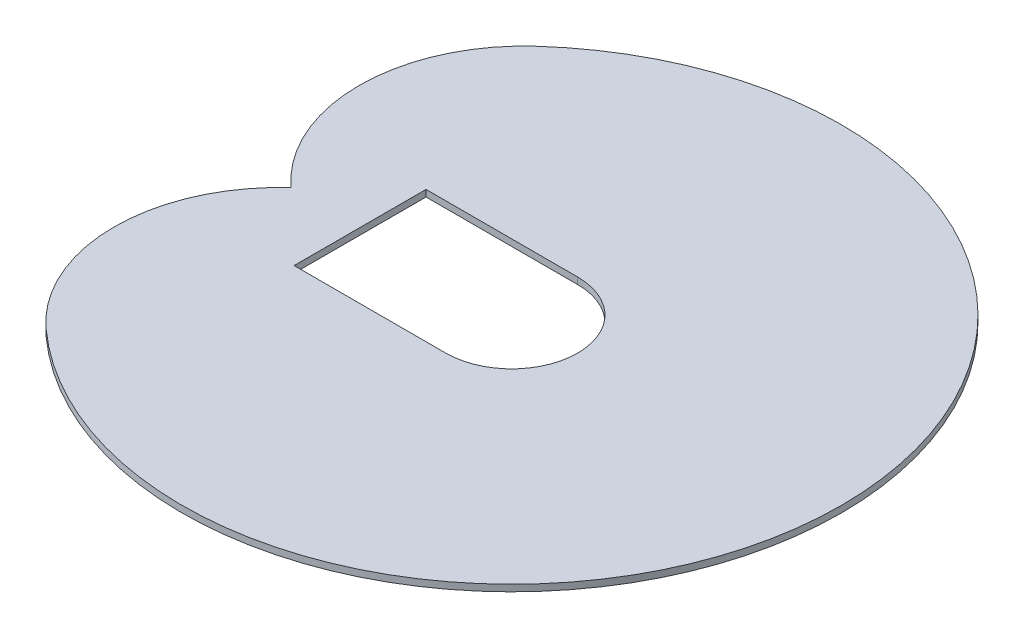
from build123d import *

# Parameters (mm, degrees)
EXTRUDE_1_DEPTH = 10


with BuildPart() as part:
    # Sketch 1 → Extrude 1 (new body)
    with BuildSketch(Plane(origin=(0, 0, 0), x_dir=(1, 0, 0), z_dir=(0, 1, 0))):
        with BuildLine():
            ThreePointArc((-334.565303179, 371.572412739), (-417.28265159, 185.786206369), (-334.565303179, 0))
            ThreePointArc((-334.565303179, 0), (-417.28265159, -185.786206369), (-334.565303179, -371.572412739))
            ThreePointArc((-334.565303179, -371.572412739), (500, 0), (-334.565303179, 371.572412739))
        make_face()
        with BuildLine():
            Line((0, 100), (-230, 100))
            Line((-230, 100), (-230, -100))
            Line((-230, -100), (0, -100))
            ThreePointArc((0, -100), (100, 0), (0, 100))
        make_face(mode=Mode.SUBTRACT)
    extrude(amount=EXTRUDE_1_DEPTH)


solid = part.part
